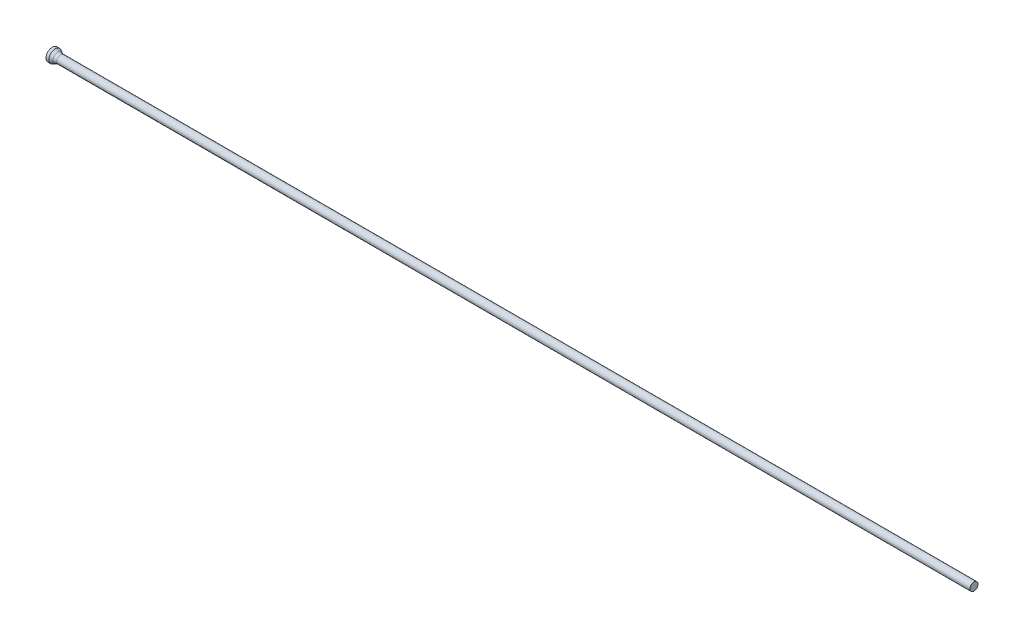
ISO-10303-21;
HEADER;
FILE_DESCRIPTION(('STEP AP214'),'2;1');
FILE_NAME('part.step','',(''),(''),'','','');
FILE_SCHEMA(('AUTOMOTIVE_DESIGN { 1 0 10303 214 1 1 1 1 }'));
ENDSEC;
DATA;
#1=APPLICATION_CONTEXT('core data for automotive mechanical design processes');
#2=APPLICATION_PROTOCOL_DEFINITION('international standard','automotive_design',2000,#1);
#3=PRODUCT_CONTEXT('',#1,'mechanical');
#4=PRODUCT('Part','Part','',(#3));
#5=PRODUCT_RELATED_PRODUCT_CATEGORY('part','',(#4));
#6=PRODUCT_DEFINITION_FORMATION('','',#4);
#7=PRODUCT_DEFINITION_CONTEXT('part definition',#1,'design');
#8=PRODUCT_DEFINITION('design','',#6,#7);
#9=PRODUCT_DEFINITION_SHAPE('','',#8);
#10=(LENGTH_UNIT() NAMED_UNIT(*) SI_UNIT(.MILLI.,.METRE.));
#11=(NAMED_UNIT(*) PLANE_ANGLE_UNIT() SI_UNIT($,.RADIAN.));
#12=(NAMED_UNIT(*) SI_UNIT($,.STERADIAN.) SOLID_ANGLE_UNIT());
#13=UNCERTAINTY_MEASURE_WITH_UNIT(LENGTH_MEASURE(1.E-05),#10,'distance_accuracy_value','');
#14=(GEOMETRIC_REPRESENTATION_CONTEXT(3) GLOBAL_UNCERTAINTY_ASSIGNED_CONTEXT((#13)) GLOBAL_UNIT_ASSIGNED_CONTEXT((#10,
#11,#12)) REPRESENTATION_CONTEXT('',''));
#15=CARTESIAN_POINT('',(0.,0.,0.));
#16=DIRECTION('',(0.,0.,1.));
#17=DIRECTION('',(1.,0.,0.));
#18=AXIS2_PLACEMENT_3D('',#15,#16,#17);
#19=CARTESIAN_POINT('',(0.,0.,0.));
#20=DIRECTION('',(1.,0.,0.));
#21=DIRECTION('',(0.,0.,-1.));
#22=AXIS2_PLACEMENT_3D('',#19,#20,#21);
#23=PLANE('',#22);
#24=CARTESIAN_POINT('',(0.,0.,0.));
#25=DIRECTION('',(-1.,0.,0.));
#26=DIRECTION('',(0.,0.,1.));
#27=AXIS2_PLACEMENT_3D('',#24,#25,#26);
#28=CIRCLE('',#27,1.1);
#29=CARTESIAN_POINT('',(0.,0.,1.1));
#30=VERTEX_POINT('',#29);
#31=EDGE_CURVE('E25',#30,#30,#28,.T.);
#32=ORIENTED_EDGE('',*,*,#31,.T.);
#33=EDGE_LOOP('',(#32));
#34=FACE_BOUND('',#33,.T.);
#35=ADVANCED_FACE('F14',(#34),#23,.F.);
#36=CARTESIAN_POINT('',(0.,0.,0.));
#37=DIRECTION('',(-1.,0.,0.));
#38=DIRECTION('',(0.,0.,1.));
#39=AXIS2_PLACEMENT_3D('',#36,#37,#38);
#40=CYLINDRICAL_SURFACE('',#39,1.1);
#41=ORIENTED_EDGE('',*,*,#31,.F.);
#42=EDGE_LOOP('',(#41));
#43=FACE_BOUND('',#42,.T.);
#44=CARTESIAN_POINT('',(0.497179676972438,0.,0.));
#45=DIRECTION('',(-1.,0.,0.));
#46=DIRECTION('',(0.,0.,1.));
#47=AXIS2_PLACEMENT_3D('',#44,#45,#46);
#48=CIRCLE('',#47,1.1);
#49=CARTESIAN_POINT('',(0.497179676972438,0.,1.1));
#50=VERTEX_POINT('',#49);
#51=EDGE_CURVE('E29',#50,#50,#48,.T.);
#52=ORIENTED_EDGE('',*,*,#51,.T.);
#53=EDGE_LOOP('',(#52));
#54=FACE_BOUND('',#53,.T.);
#55=ADVANCED_FACE('F53',(#43,#54),#40,.T.);
#56=CARTESIAN_POINT('',(1.19,0.,0.));
#57=DIRECTION('',(-1.,0.,0.));
#58=DIRECTION('',(0.,0.,1.));
#59=AXIS2_PLACEMENT_3D('',#56,#57,#58);
#60=CONICAL_SURFACE('',#59,0.7,0.523598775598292);
#61=CARTESIAN_POINT('',(0.957949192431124,0.,0.));
#62=DIRECTION('',(-1.,0.,0.));
#63=DIRECTION('',(0.,0.,1.));
#64=AXIS2_PLACEMENT_3D('',#61,#62,#63);
#65=CIRCLE('',#64,0.833974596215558);
#66=CARTESIAN_POINT('',(0.957949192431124,0.,0.833974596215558));
#67=VERTEX_POINT('',#66);
#68=EDGE_CURVE('E21',#67,#67,#65,.T.);
#69=ORIENTED_EDGE('',*,*,#68,.T.);
#70=EDGE_LOOP('',(#69));
#71=FACE_BOUND('',#70,.T.);
#72=ORIENTED_EDGE('',*,*,#51,.F.);
#73=EDGE_LOOP('',(#72));
#74=FACE_BOUND('',#73,.T.);
#75=ADVANCED_FACE('F50',(#71,#74),#60,.T.);
#76=CARTESIAN_POINT('',(0.,0.,0.));
#77=DIRECTION('',(-1.,0.,0.));
#78=DIRECTION('',(0.,0.,1.));
#79=AXIS2_PLACEMENT_3D('',#76,#77,#78);
#80=CYLINDRICAL_SURFACE('',#79,0.7);
#81=CARTESIAN_POINT('',(1.45794919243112,0.,0.));
#82=DIRECTION('',(-1.,0.,0.));
#83=DIRECTION('',(0.,0.,1.));
#84=AXIS2_PLACEMENT_3D('',#81,#82,#83);
#85=CIRCLE('',#84,0.7);
#86=CARTESIAN_POINT('',(1.45794919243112,0.,0.7));
#87=VERTEX_POINT('',#86);
#88=EDGE_CURVE('E9',#87,#87,#85,.F.);
#89=ORIENTED_EDGE('',*,*,#88,.T.);
#90=EDGE_LOOP('',(#89));
#91=FACE_BOUND('',#90,.T.);
#92=CARTESIAN_POINT('',(160.,0.,0.));
#93=DIRECTION('',(-1.,0.,0.));
#94=DIRECTION('',(0.,0.,1.));
#95=AXIS2_PLACEMENT_3D('',#92,#93,#94);
#96=CIRCLE('',#95,0.7);
#97=CARTESIAN_POINT('',(160.,0.,0.7));
#98=VERTEX_POINT('',#97);
#99=EDGE_CURVE('E34',#98,#98,#96,.T.);
#100=ORIENTED_EDGE('',*,*,#99,.T.);
#101=EDGE_LOOP('',(#100));
#102=FACE_BOUND('',#101,.T.);
#103=ADVANCED_FACE('F38',(#91,#102),#80,.T.);
#104=CARTESIAN_POINT('',(160.,0.7,0.));
#105=DIRECTION('',(-1.,0.,0.));
#106=DIRECTION('',(0.,0.,1.));
#107=AXIS2_PLACEMENT_3D('',#104,#105,#106);
#108=PLANE('',#107);
#109=ORIENTED_EDGE('',*,*,#99,.F.);
#110=EDGE_LOOP('',(#109));
#111=FACE_BOUND('',#110,.T.);
#112=ADVANCED_FACE('F40',(#111),#108,.F.);
#113=CARTESIAN_POINT('',(1.45794919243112,0.,0.));
#114=DIRECTION('',(-1.,0.,0.));
#115=DIRECTION('',(0.,0.,1.));
#116=AXIS2_PLACEMENT_3D('',#113,#114,#115);
#117=TOROIDAL_SURFACE('',#116,1.7,1.);
#118=ORIENTED_EDGE('',*,*,#88,.F.);
#119=EDGE_LOOP('',(#118));
#120=FACE_BOUND('',#119,.T.);
#121=ORIENTED_EDGE('',*,*,#68,.F.);
#122=EDGE_LOOP('',(#121));
#123=FACE_BOUND('',#122,.T.);
#124=ADVANCED_FACE('F16',(#120,#123),#117,.F.);
#125=CLOSED_SHELL('',(#35,#55,#75,#103,#112,#124));
#126=MANIFOLD_SOLID_BREP('B1',#125);
#127=ADVANCED_BREP_SHAPE_REPRESENTATION('',(#18,#126),#14);
#128=SHAPE_DEFINITION_REPRESENTATION(#9,#127);
ENDSEC;
END-ISO-10303-21;
